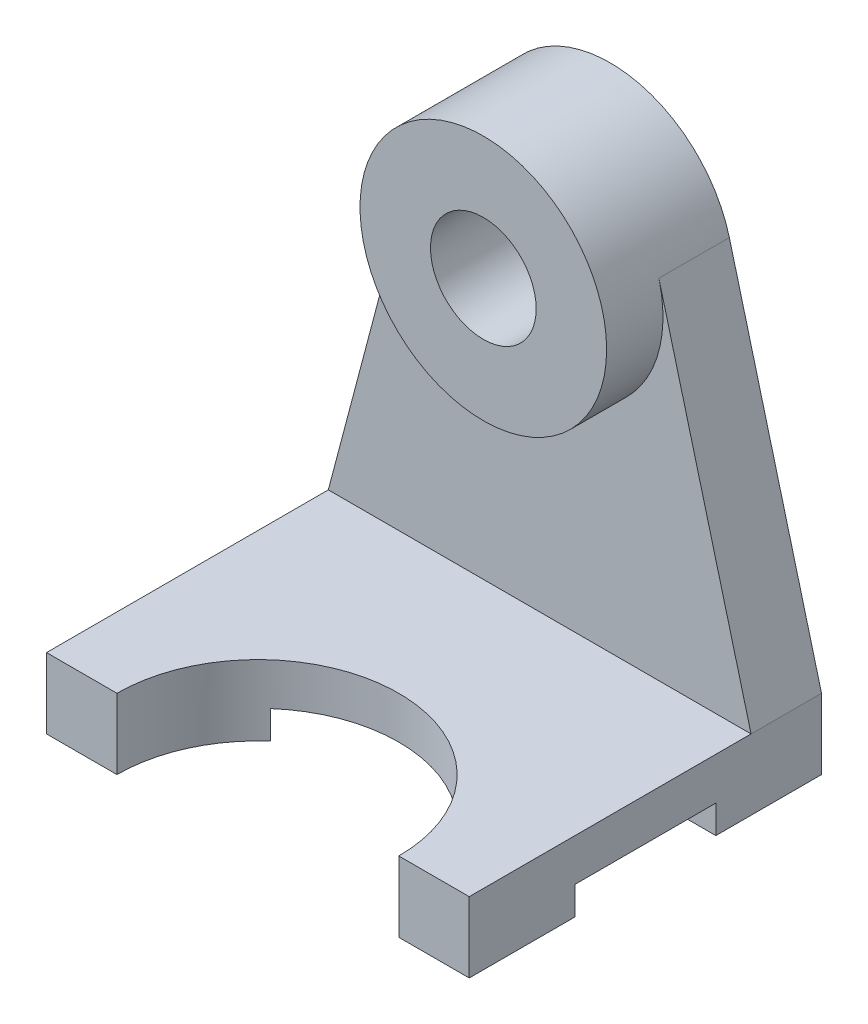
from build123d import *

# Parameters (mm, degrees)
EXTRUDE_1_DEPTH     = 10
SKETCH_2_W          = 20
SKETCH_2_H          = 4
CUT_EXTRUDE_1_DEPTH = 79.74007874
SKETCH_4_R          = 7.5
EXTRUDE_2_DEPTH     = 10
SKETCH_5_R          = 17.5
SKETCH_5_R_2        = 7.5
EXTRUDE_3_DEPTH     = 8


with BuildPart() as part:
    # Sketch 1 → Extrude 1 (new body)
    with BuildSketch(Plane(origin=(0, 0, 0), x_dir=(1, 0, 0), z_dir=(0, 1, 0))):
        with BuildLine():
            Line((50, 0), (60, 0))
            Line((60, 0), (60, 50))
            Line((60, 50), (0, 50))
            Line((0, 50), (0, 0))
            Line((0, 0), (10, 0))
            ThreePointArc((10, 0), (30, 20), (50, 0))
        make_face()
    extrude(amount=EXTRUDE_1_DEPTH)

    # Sketch 2 → Cut-Extrude 1 (cut, through all)
    with BuildSketch(Plane(origin=(60, 0, 0), x_dir=(0, 0, -1), z_dir=(1, 0, 0))):
        with Locations((25, 2)):
            Rectangle(SKETCH_2_W, SKETCH_2_H)
    extrude(amount=-CUT_EXTRUDE_1_DEPTH, mode=Mode.SUBTRACT)

    # Sketch 4 → Extrude 2 (add)
    with BuildSketch(Plane(origin=(0, 0, -50), x_dir=(-1, 0, 0), z_dir=(0, 0, -1))):
        with BuildLine():
            Line((-46.918566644, 59.473488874), (-60, 10))
            Line((-60, 10), (0, 10))
            Line((0, 10), (-13.081433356, 59.473488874))
            ThreePointArc((-13.081433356, 59.473488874), (-30, 72.5), (-46.918566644, 59.473488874))
        make_face()
        with Locations((-30, 55)):
            Circle(SKETCH_4_R, mode=Mode.SUBTRACT)
    extrude(amount=-EXTRUDE_2_DEPTH)

    # Sketch 5 → Extrude 3 (add)
    with BuildSketch(Plane.XY.offset(-40)):
        with Locations(Location((30, 55, 0), (0, 0, 165.189203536))):
            Circle(SKETCH_5_R)
        with Locations(Location((30, 55, 0), (0, 0, 180))):
            Circle(SKETCH_5_R_2, mode=Mode.SUBTRACT)
    extrude(amount=EXTRUDE_3_DEPTH)


solid = part.part
